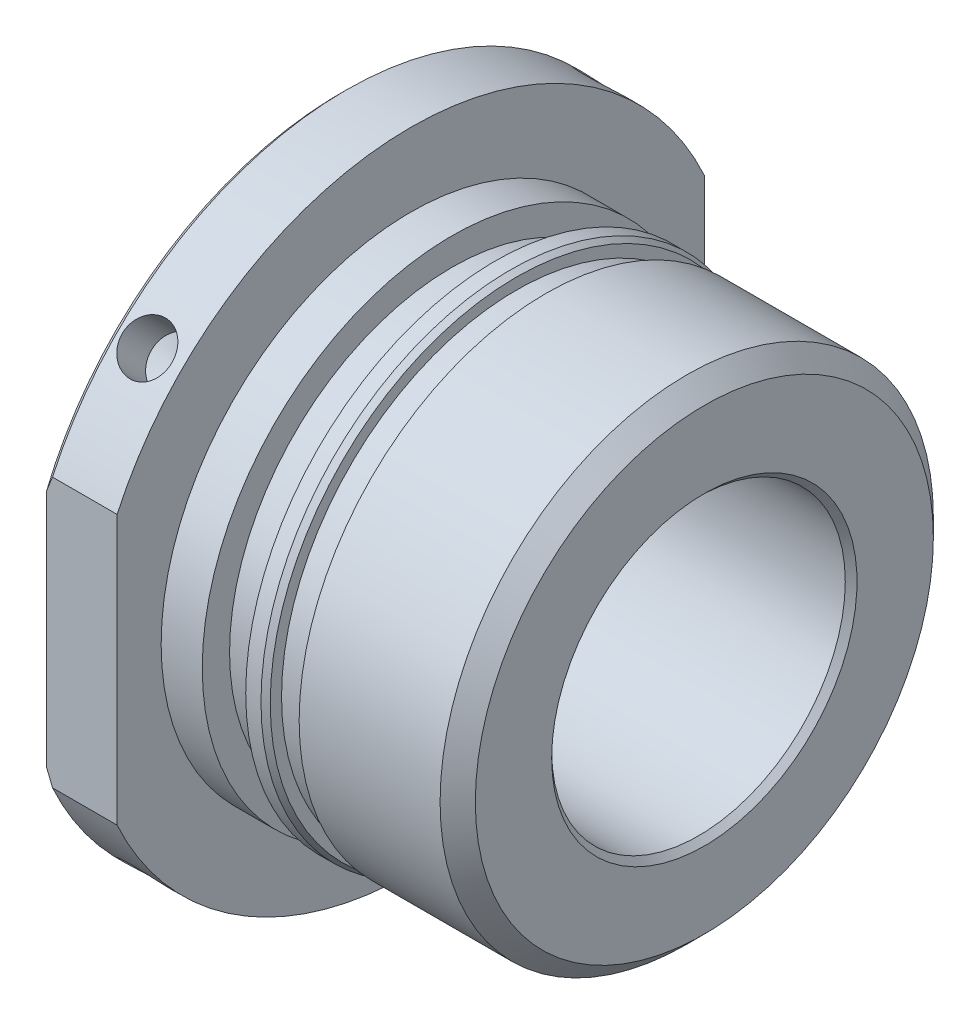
from build123d import *

# Parameters (mm, degrees)
ESQUISSE2_OUTSIDE_W          = 145.492
ESQUISSE2_OUTSIDE_H          = 145.492
ESQUISSE2_OUTSIDE_W_2        = 100
ESQUISSE2_OUTSIDE_H_2        = 124.747688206
EXTRUSION1_DEPTH             = 20
R_P_TITION_CIRCULAIRE1_COUNT = 4


with BuildPart() as part:
    # Esquisse1 → R_volution1 (revolve)
    with BuildSketch(Plane.XY, mode=Mode.PRIVATE) as r_volution1_sk:
        Polygon((61, 25), (62, 26), (62, 39), (59, 42), (35, 42), (35, 40), (30, 40), (30, 41.922649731), (29, 42.5), (26.4, 42.5), (26.4, 37.85), (19, 37.85), (19, 42.5), (12, 42.5), (12, 55), (1, 55), (0, 54), (0, 27.75), (2, 27.75), (2, 29), (7, 29), (7, 25), (12, 25), (12, 30), (23, 30), (23, 25), align=None)
    revolve(r_volution1_sk.sketch.rotate(Axis((0, 0, 0), (1, 0, 0)), 90), axis=Axis((0, 0, 0), (1, 0, 0)))

    # Esquisse2 outside → Extrusion1 (cut)
    with BuildSketch(Plane.ZY):
        Rectangle(ESQUISSE2_OUTSIDE_W, ESQUISSE2_OUTSIDE_H)
        with Locations((0, -1.086084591)):
            Rectangle(ESQUISSE2_OUTSIDE_W_2, ESQUISSE2_OUTSIDE_H_2, mode=Mode.SUBTRACT)
    extrude(amount=-EXTRUSION1_DEPTH, mode=Mode.SUBTRACT)

    # Esquisse6 → D_gagement M81 (revolve, cut)
    with BuildSketch(Plane(origin=(6, 38.890872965, -38.890872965), x_dir=(0, 0.7071067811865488, 0.7071067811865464), z_dir=(1, 0, 0))):
        Polygon((0, 0), (0, 9.553657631), (4.25, 7), (4.25, 0), align=None)
    d_gagement_m81 = revolve(axis=Axis((6, 43.381001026, -43.381001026), (0, -0.7071067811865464, 0.7071067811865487)), mode=Mode.SUBTRACT)

    # R_p_tition circulaire1: D_gagement M81 ×4 about axis
    r_p_tition_circulaire1_axis = Axis((0, 0, 0), (-1, 0, 0))
    for i in range(1, R_P_TITION_CIRCULAIRE1_COUNT):
        add(d_gagement_m81.rotate(r_p_tition_circulaire1_axis, i * 360 / R_P_TITION_CIRCULAIRE1_COUNT), mode=Mode.SUBTRACT)


solid = part.part
